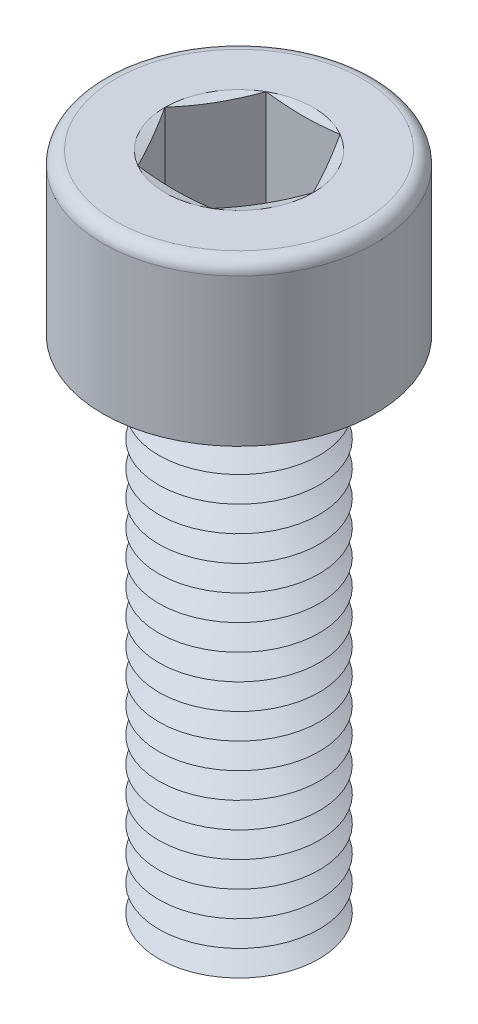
ISO-10303-21;
HEADER;
FILE_DESCRIPTION(('STEP AP214'),'2;1');
FILE_NAME('part.step','',(''),(''),'','','');
FILE_SCHEMA(('AUTOMOTIVE_DESIGN { 1 0 10303 214 1 1 1 1 }'));
ENDSEC;
DATA;
#1=APPLICATION_CONTEXT('core data for automotive mechanical design processes');
#2=APPLICATION_PROTOCOL_DEFINITION('international standard','automotive_design',2000,#1);
#3=PRODUCT_CONTEXT('',#1,'mechanical');
#4=PRODUCT('Part','Part','',(#3));
#5=PRODUCT_RELATED_PRODUCT_CATEGORY('part','',(#4));
#6=PRODUCT_DEFINITION_FORMATION('','',#4);
#7=PRODUCT_DEFINITION_CONTEXT('part definition',#1,'design');
#8=PRODUCT_DEFINITION('design','',#6,#7);
#9=PRODUCT_DEFINITION_SHAPE('','',#8);
#10=(LENGTH_UNIT() NAMED_UNIT(*) SI_UNIT(.MILLI.,.METRE.));
#11=(NAMED_UNIT(*) PLANE_ANGLE_UNIT() SI_UNIT($,.RADIAN.));
#12=(NAMED_UNIT(*) SI_UNIT($,.STERADIAN.) SOLID_ANGLE_UNIT());
#13=UNCERTAINTY_MEASURE_WITH_UNIT(LENGTH_MEASURE(1.E-05),#10,'distance_accuracy_value','');
#14=(GEOMETRIC_REPRESENTATION_CONTEXT(3) GLOBAL_UNCERTAINTY_ASSIGNED_CONTEXT((#13)) GLOBAL_UNIT_ASSIGNED_CONTEXT((#10,
#11,#12)) REPRESENTATION_CONTEXT('',''));
#15=CARTESIAN_POINT('',(0.,0.,0.));
#16=DIRECTION('',(0.,0.,1.));
#17=DIRECTION('',(1.,0.,0.));
#18=AXIS2_PLACEMENT_3D('',#15,#16,#17);
#19=CARTESIAN_POINT('',(0.,3.2,0.));
#20=DIRECTION('',(0.,1.,0.));
#21=DIRECTION('',(0.,0.,1.));
#22=AXIS2_PLACEMENT_3D('',#19,#20,#21);
#23=CONICAL_SURFACE('',#22,1.80717967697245,1.0471975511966);
#24=CARTESIAN_POINT('',(0.,3.6,0.));
#25=DIRECTION('',(0.,1.,0.));
#26=DIRECTION('',(0.,0.,1.));
#27=AXIS2_PLACEMENT_3D('',#24,#25,#26);
#28=CIRCLE('',#27,2.5);
#29=CARTESIAN_POINT('',(0.,3.6,2.5));
#30=VERTEX_POINT('',#29);
#31=EDGE_CURVE('E470',#30,#30,#28,.T.);
#32=ORIENTED_EDGE('',*,*,#31,.F.);
#33=EDGE_LOOP('',(#32));
#34=FACE_BOUND('',#33,.T.);
#35=CARTESIAN_POINT('',(0.,3.2,0.));
#36=DIRECTION('',(0.,1.,0.));
#37=DIRECTION('',(0.,0.,1.));
#38=AXIS2_PLACEMENT_3D('',#35,#36,#37);
#39=CIRCLE('',#38,1.80717967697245);
#40=CARTESIAN_POINT('',(0.,3.2,1.80717967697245));
#41=VERTEX_POINT('',#40);
#42=EDGE_CURVE('E474',#41,#41,#39,.T.);
#43=ORIENTED_EDGE('',*,*,#42,.T.);
#44=EDGE_LOOP('',(#43));
#45=FACE_BOUND('',#44,.T.);
#46=ADVANCED_FACE('F41',(#34,#45),#23,.T.);
#47=CARTESIAN_POINT('',(0.,2.8,0.));
#48=DIRECTION('',(0.,-1.,0.));
#49=DIRECTION('',(0.,0.,-1.));
#50=AXIS2_PLACEMENT_3D('',#47,#48,#49);
#51=CONICAL_SURFACE('',#50,2.5,1.0471975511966);
#52=ORIENTED_EDGE('',*,*,#42,.F.);
#53=EDGE_LOOP('',(#52));
#54=FACE_BOUND('',#53,.T.);
#55=CARTESIAN_POINT('',(0.,2.8,0.));
#56=DIRECTION('',(0.,1.,0.));
#57=DIRECTION('',(0.,0.,1.));
#58=AXIS2_PLACEMENT_3D('',#55,#56,#57);
#59=CIRCLE('',#58,2.5);
#60=CARTESIAN_POINT('',(0.,2.8,2.5));
#61=VERTEX_POINT('',#60);
#62=EDGE_CURVE('E478',#61,#61,#59,.T.);
#63=ORIENTED_EDGE('',*,*,#62,.T.);
#64=EDGE_LOOP('',(#63));
#65=FACE_BOUND('',#64,.T.);
#66=ADVANCED_FACE('F251',(#54,#65),#51,.T.);
#67=CARTESIAN_POINT('',(0.,0.,0.));
#68=DIRECTION('',(0.,1.,0.));
#69=DIRECTION('',(0.,0.,1.));
#70=AXIS2_PLACEMENT_3D('',#67,#68,#69);
#71=PLANE('',#70);
#72=CARTESIAN_POINT('',(0.,0.,0.));
#73=DIRECTION('',(0.,1.,0.));
#74=DIRECTION('',(0.,0.,1.));
#75=AXIS2_PLACEMENT_3D('',#72,#73,#74);
#76=CIRCLE('',#75,1.80717967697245);
#77=CARTESIAN_POINT('',(0.,0.,1.80717967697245));
#78=VERTEX_POINT('',#77);
#79=EDGE_CURVE('E506',#78,#78,#76,.T.);
#80=ORIENTED_EDGE('',*,*,#79,.F.);
#81=EDGE_LOOP('',(#80));
#82=FACE_BOUND('',#81,.T.);
#83=ADVANCED_FACE('F248',(#82),#71,.F.);
#84=CARTESIAN_POINT('',(0.,0.,0.));
#85=DIRECTION('',(0.,1.,0.));
#86=DIRECTION('',(0.,0.,1.));
#87=AXIS2_PLACEMENT_3D('',#84,#85,#86);
#88=CONICAL_SURFACE('',#87,1.80717967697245,1.0471975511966);
#89=CARTESIAN_POINT('',(0.,0.399999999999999,0.));
#90=DIRECTION('',(0.,1.,0.));
#91=DIRECTION('',(0.,0.,1.));
#92=AXIS2_PLACEMENT_3D('',#89,#90,#91);
#93=CIRCLE('',#92,2.5);
#94=CARTESIAN_POINT('',(0.,0.399999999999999,2.5));
#95=VERTEX_POINT('',#94);
#96=EDGE_CURVE('E502',#95,#95,#93,.T.);
#97=ORIENTED_EDGE('',*,*,#96,.F.);
#98=EDGE_LOOP('',(#97));
#99=FACE_BOUND('',#98,.T.);
#100=ORIENTED_EDGE('',*,*,#79,.T.);
#101=EDGE_LOOP('',(#100));
#102=FACE_BOUND('',#101,.T.);
#103=ADVANCED_FACE('F250',(#99,#102),#88,.T.);
#104=CARTESIAN_POINT('',(0.,0.399999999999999,0.));
#105=DIRECTION('',(0.,-1.,0.));
#106=DIRECTION('',(0.,0.,-1.));
#107=AXIS2_PLACEMENT_3D('',#104,#105,#106);
#108=CONICAL_SURFACE('',#107,2.5,1.0471975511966);
#109=CARTESIAN_POINT('',(0.,0.8,0.));
#110=DIRECTION('',(0.,1.,0.));
#111=DIRECTION('',(0.,0.,1.));
#112=AXIS2_PLACEMENT_3D('',#109,#110,#111);
#113=CIRCLE('',#112,1.80717967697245);
#114=CARTESIAN_POINT('',(0.,0.8,1.80717967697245));
#115=VERTEX_POINT('',#114);
#116=EDGE_CURVE('E498',#115,#115,#113,.T.);
#117=ORIENTED_EDGE('',*,*,#116,.F.);
#118=EDGE_LOOP('',(#117));
#119=FACE_BOUND('',#118,.T.);
#120=ORIENTED_EDGE('',*,*,#96,.T.);
#121=EDGE_LOOP('',(#120));
#122=FACE_BOUND('',#121,.T.);
#123=ADVANCED_FACE('F291',(#119,#122),#108,.T.);
#124=CARTESIAN_POINT('',(0.,0.8,0.));
#125=DIRECTION('',(0.,1.,0.));
#126=DIRECTION('',(0.,0.,1.));
#127=AXIS2_PLACEMENT_3D('',#124,#125,#126);
#128=CONICAL_SURFACE('',#127,1.80717967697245,1.0471975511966);
#129=CARTESIAN_POINT('',(0.,1.2,0.));
#130=DIRECTION('',(0.,1.,0.));
#131=DIRECTION('',(0.,0.,1.));
#132=AXIS2_PLACEMENT_3D('',#129,#130,#131);
#133=CIRCLE('',#132,2.5);
#134=CARTESIAN_POINT('',(0.,1.2,2.5));
#135=VERTEX_POINT('',#134);
#136=EDGE_CURVE('E494',#135,#135,#133,.T.);
#137=ORIENTED_EDGE('',*,*,#136,.F.);
#138=EDGE_LOOP('',(#137));
#139=FACE_BOUND('',#138,.T.);
#140=ORIENTED_EDGE('',*,*,#116,.T.);
#141=EDGE_LOOP('',(#140));
#142=FACE_BOUND('',#141,.T.);
#143=ADVANCED_FACE('F286',(#139,#142),#128,.T.);
#144=CARTESIAN_POINT('',(0.,1.2,0.));
#145=DIRECTION('',(0.,-1.,0.));
#146=DIRECTION('',(0.,0.,-1.));
#147=AXIS2_PLACEMENT_3D('',#144,#145,#146);
#148=CONICAL_SURFACE('',#147,2.5,1.0471975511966);
#149=CARTESIAN_POINT('',(0.,1.6,0.));
#150=DIRECTION('',(0.,1.,0.));
#151=DIRECTION('',(0.,0.,1.));
#152=AXIS2_PLACEMENT_3D('',#149,#150,#151);
#153=CIRCLE('',#152,1.80717967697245);
#154=CARTESIAN_POINT('',(0.,1.6,1.80717967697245));
#155=VERTEX_POINT('',#154);
#156=EDGE_CURVE('E490',#155,#155,#153,.T.);
#157=ORIENTED_EDGE('',*,*,#156,.F.);
#158=EDGE_LOOP('',(#157));
#159=FACE_BOUND('',#158,.T.);
#160=ORIENTED_EDGE('',*,*,#136,.T.);
#161=EDGE_LOOP('',(#160));
#162=FACE_BOUND('',#161,.T.);
#163=ADVANCED_FACE('F283',(#159,#162),#148,.T.);
#164=CARTESIAN_POINT('',(0.,1.6,0.));
#165=DIRECTION('',(0.,1.,0.));
#166=DIRECTION('',(0.,0.,1.));
#167=AXIS2_PLACEMENT_3D('',#164,#165,#166);
#168=CONICAL_SURFACE('',#167,1.80717967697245,1.0471975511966);
#169=CARTESIAN_POINT('',(0.,2.,0.));
#170=DIRECTION('',(0.,1.,0.));
#171=DIRECTION('',(0.,0.,1.));
#172=AXIS2_PLACEMENT_3D('',#169,#170,#171);
#173=CIRCLE('',#172,2.5);
#174=CARTESIAN_POINT('',(0.,2.,2.5));
#175=VERTEX_POINT('',#174);
#176=EDGE_CURVE('E486',#175,#175,#173,.T.);
#177=ORIENTED_EDGE('',*,*,#176,.F.);
#178=EDGE_LOOP('',(#177));
#179=FACE_BOUND('',#178,.T.);
#180=ORIENTED_EDGE('',*,*,#156,.T.);
#181=EDGE_LOOP('',(#180));
#182=FACE_BOUND('',#181,.T.);
#183=ADVANCED_FACE('F277',(#179,#182),#168,.T.);
#184=CARTESIAN_POINT('',(0.,2.,0.));
#185=DIRECTION('',(0.,-1.,0.));
#186=DIRECTION('',(0.,0.,-1.));
#187=AXIS2_PLACEMENT_3D('',#184,#185,#186);
#188=CONICAL_SURFACE('',#187,2.5,1.0471975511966);
#189=CARTESIAN_POINT('',(0.,2.4,0.));
#190=DIRECTION('',(0.,1.,0.));
#191=DIRECTION('',(0.,0.,1.));
#192=AXIS2_PLACEMENT_3D('',#189,#190,#191);
#193=CIRCLE('',#192,1.80717967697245);
#194=CARTESIAN_POINT('',(0.,2.4,1.80717967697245));
#195=VERTEX_POINT('',#194);
#196=EDGE_CURVE('E482',#195,#195,#193,.T.);
#197=ORIENTED_EDGE('',*,*,#196,.F.);
#198=EDGE_LOOP('',(#197));
#199=FACE_BOUND('',#198,.T.);
#200=ORIENTED_EDGE('',*,*,#176,.T.);
#201=EDGE_LOOP('',(#200));
#202=FACE_BOUND('',#201,.T.);
#203=ADVANCED_FACE('F273',(#199,#202),#188,.T.);
#204=CARTESIAN_POINT('',(0.,2.4,0.));
#205=DIRECTION('',(0.,1.,0.));
#206=DIRECTION('',(0.,0.,1.));
#207=AXIS2_PLACEMENT_3D('',#204,#205,#206);
#208=CONICAL_SURFACE('',#207,1.80717967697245,1.0471975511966);
#209=ORIENTED_EDGE('',*,*,#62,.F.);
#210=EDGE_LOOP('',(#209));
#211=FACE_BOUND('',#210,.T.);
#212=ORIENTED_EDGE('',*,*,#196,.T.);
#213=EDGE_LOOP('',(#212));
#214=FACE_BOUND('',#213,.T.);
#215=ADVANCED_FACE('F276',(#211,#214),#208,.T.);
#216=CARTESIAN_POINT('',(0.,4.,0.));
#217=DIRECTION('',(0.,1.,0.));
#218=DIRECTION('',(0.,0.,1.));
#219=AXIS2_PLACEMENT_3D('',#216,#217,#218);
#220=CONICAL_SURFACE('',#219,1.80717967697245,1.0471975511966);
#221=CARTESIAN_POINT('',(0.,4.4,0.));
#222=DIRECTION('',(0.,1.,0.));
#223=DIRECTION('',(0.,0.,1.));
#224=AXIS2_PLACEMENT_3D('',#221,#222,#223);
#225=CIRCLE('',#224,2.5);
#226=CARTESIAN_POINT('',(0.,4.4,2.5));
#227=VERTEX_POINT('',#226);
#228=EDGE_CURVE('E462',#227,#227,#225,.T.);
#229=ORIENTED_EDGE('',*,*,#228,.F.);
#230=EDGE_LOOP('',(#229));
#231=FACE_BOUND('',#230,.T.);
#232=CARTESIAN_POINT('',(0.,4.,0.));
#233=DIRECTION('',(0.,1.,0.));
#234=DIRECTION('',(0.,0.,1.));
#235=AXIS2_PLACEMENT_3D('',#232,#233,#234);
#236=CIRCLE('',#235,1.80717967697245);
#237=CARTESIAN_POINT('',(0.,4.,1.80717967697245));
#238=VERTEX_POINT('',#237);
#239=EDGE_CURVE('E466',#238,#238,#236,.T.);
#240=ORIENTED_EDGE('',*,*,#239,.T.);
#241=EDGE_LOOP('',(#240));
#242=FACE_BOUND('',#241,.T.);
#243=ADVANCED_FACE('F281',(#231,#242),#220,.T.);
#244=CARTESIAN_POINT('',(0.,3.6,0.));
#245=DIRECTION('',(0.,-1.,0.));
#246=DIRECTION('',(0.,0.,-1.));
#247=AXIS2_PLACEMENT_3D('',#244,#245,#246);
#248=CONICAL_SURFACE('',#247,2.5,1.0471975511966);
#249=ORIENTED_EDGE('',*,*,#239,.F.);
#250=EDGE_LOOP('',(#249));
#251=FACE_BOUND('',#250,.T.);
#252=ORIENTED_EDGE('',*,*,#31,.T.);
#253=EDGE_LOOP('',(#252));
#254=FACE_BOUND('',#253,.T.);
#255=ADVANCED_FACE('F873',(#251,#254),#248,.T.);
#256=CARTESIAN_POINT('',(0.,4.8,0.));
#257=DIRECTION('',(0.,1.,0.));
#258=DIRECTION('',(0.,0.,1.));
#259=AXIS2_PLACEMENT_3D('',#256,#257,#258);
#260=CONICAL_SURFACE('',#259,1.80717967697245,1.0471975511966);
#261=CARTESIAN_POINT('',(0.,5.2,0.));
#262=DIRECTION('',(0.,1.,0.));
#263=DIRECTION('',(0.,0.,1.));
#264=AXIS2_PLACEMENT_3D('',#261,#262,#263);
#265=CIRCLE('',#264,2.5);
#266=CARTESIAN_POINT('',(0.,5.2,2.5));
#267=VERTEX_POINT('',#266);
#268=EDGE_CURVE('E454',#267,#267,#265,.T.);
#269=ORIENTED_EDGE('',*,*,#268,.F.);
#270=EDGE_LOOP('',(#269));
#271=FACE_BOUND('',#270,.T.);
#272=CARTESIAN_POINT('',(0.,4.8,0.));
#273=DIRECTION('',(0.,1.,0.));
#274=DIRECTION('',(0.,0.,1.));
#275=AXIS2_PLACEMENT_3D('',#272,#273,#274);
#276=CIRCLE('',#275,1.80717967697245);
#277=CARTESIAN_POINT('',(0.,4.8,1.80717967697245));
#278=VERTEX_POINT('',#277);
#279=EDGE_CURVE('E458',#278,#278,#276,.T.);
#280=ORIENTED_EDGE('',*,*,#279,.T.);
#281=EDGE_LOOP('',(#280));
#282=FACE_BOUND('',#281,.T.);
#283=ADVANCED_FACE('F864',(#271,#282),#260,.T.);
#284=CARTESIAN_POINT('',(0.,4.4,0.));
#285=DIRECTION('',(0.,-1.,0.));
#286=DIRECTION('',(0.,0.,-1.));
#287=AXIS2_PLACEMENT_3D('',#284,#285,#286);
#288=CONICAL_SURFACE('',#287,2.5,1.0471975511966);
#289=ORIENTED_EDGE('',*,*,#279,.F.);
#290=EDGE_LOOP('',(#289));
#291=FACE_BOUND('',#290,.T.);
#292=ORIENTED_EDGE('',*,*,#228,.T.);
#293=EDGE_LOOP('',(#292));
#294=FACE_BOUND('',#293,.T.);
#295=ADVANCED_FACE('F855',(#291,#294),#288,.T.);
#296=CARTESIAN_POINT('',(0.,5.6,0.));
#297=DIRECTION('',(0.,1.,0.));
#298=DIRECTION('',(0.,0.,1.));
#299=AXIS2_PLACEMENT_3D('',#296,#297,#298);
#300=CONICAL_SURFACE('',#299,1.80717967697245,1.0471975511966);
#301=CARTESIAN_POINT('',(0.,6.,0.));
#302=DIRECTION('',(0.,1.,0.));
#303=DIRECTION('',(0.,0.,1.));
#304=AXIS2_PLACEMENT_3D('',#301,#302,#303);
#305=CIRCLE('',#304,2.5);
#306=CARTESIAN_POINT('',(0.,6.,2.5));
#307=VERTEX_POINT('',#306);
#308=EDGE_CURVE('E446',#307,#307,#305,.T.);
#309=ORIENTED_EDGE('',*,*,#308,.F.);
#310=EDGE_LOOP('',(#309));
#311=FACE_BOUND('',#310,.T.);
#312=CARTESIAN_POINT('',(0.,5.6,0.));
#313=DIRECTION('',(0.,1.,0.));
#314=DIRECTION('',(0.,0.,1.));
#315=AXIS2_PLACEMENT_3D('',#312,#313,#314);
#316=CIRCLE('',#315,1.80717967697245);
#317=CARTESIAN_POINT('',(0.,5.6,1.80717967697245));
#318=VERTEX_POINT('',#317);
#319=EDGE_CURVE('E450',#318,#318,#316,.T.);
#320=ORIENTED_EDGE('',*,*,#319,.T.);
#321=EDGE_LOOP('',(#320));
#322=FACE_BOUND('',#321,.T.);
#323=ADVANCED_FACE('F846',(#311,#322),#300,.T.);
#324=CARTESIAN_POINT('',(0.,5.2,0.));
#325=DIRECTION('',(0.,-1.,0.));
#326=DIRECTION('',(0.,0.,-1.));
#327=AXIS2_PLACEMENT_3D('',#324,#325,#326);
#328=CONICAL_SURFACE('',#327,2.5,1.0471975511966);
#329=ORIENTED_EDGE('',*,*,#319,.F.);
#330=EDGE_LOOP('',(#329));
#331=FACE_BOUND('',#330,.T.);
#332=ORIENTED_EDGE('',*,*,#268,.T.);
#333=EDGE_LOOP('',(#332));
#334=FACE_BOUND('',#333,.T.);
#335=ADVANCED_FACE('F837',(#331,#334),#328,.T.);
#336=CARTESIAN_POINT('',(0.,6.4,0.));
#337=DIRECTION('',(0.,1.,0.));
#338=DIRECTION('',(0.,0.,1.));
#339=AXIS2_PLACEMENT_3D('',#336,#337,#338);
#340=CONICAL_SURFACE('',#339,1.80717967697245,1.0471975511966);
#341=CARTESIAN_POINT('',(0.,6.8,0.));
#342=DIRECTION('',(0.,1.,0.));
#343=DIRECTION('',(0.,0.,1.));
#344=AXIS2_PLACEMENT_3D('',#341,#342,#343);
#345=CIRCLE('',#344,2.5);
#346=CARTESIAN_POINT('',(0.,6.8,2.5));
#347=VERTEX_POINT('',#346);
#348=EDGE_CURVE('E438',#347,#347,#345,.T.);
#349=ORIENTED_EDGE('',*,*,#348,.F.);
#350=EDGE_LOOP('',(#349));
#351=FACE_BOUND('',#350,.T.);
#352=CARTESIAN_POINT('',(0.,6.4,0.));
#353=DIRECTION('',(0.,1.,0.));
#354=DIRECTION('',(0.,0.,1.));
#355=AXIS2_PLACEMENT_3D('',#352,#353,#354);
#356=CIRCLE('',#355,1.80717967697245);
#357=CARTESIAN_POINT('',(0.,6.4,1.80717967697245));
#358=VERTEX_POINT('',#357);
#359=EDGE_CURVE('E442',#358,#358,#356,.T.);
#360=ORIENTED_EDGE('',*,*,#359,.T.);
#361=EDGE_LOOP('',(#360));
#362=FACE_BOUND('',#361,.T.);
#363=ADVANCED_FACE('F828',(#351,#362),#340,.T.);
#364=CARTESIAN_POINT('',(0.,6.,0.));
#365=DIRECTION('',(0.,-1.,0.));
#366=DIRECTION('',(0.,0.,-1.));
#367=AXIS2_PLACEMENT_3D('',#364,#365,#366);
#368=CONICAL_SURFACE('',#367,2.5,1.0471975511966);
#369=ORIENTED_EDGE('',*,*,#359,.F.);
#370=EDGE_LOOP('',(#369));
#371=FACE_BOUND('',#370,.T.);
#372=ORIENTED_EDGE('',*,*,#308,.T.);
#373=EDGE_LOOP('',(#372));
#374=FACE_BOUND('',#373,.T.);
#375=ADVANCED_FACE('F819',(#371,#374),#368,.T.);
#376=CARTESIAN_POINT('',(0.,7.2,0.));
#377=DIRECTION('',(0.,1.,0.));
#378=DIRECTION('',(0.,0.,1.));
#379=AXIS2_PLACEMENT_3D('',#376,#377,#378);
#380=CONICAL_SURFACE('',#379,1.80717967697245,1.0471975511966);
#381=CARTESIAN_POINT('',(0.,7.6,0.));
#382=DIRECTION('',(0.,1.,0.));
#383=DIRECTION('',(0.,0.,1.));
#384=AXIS2_PLACEMENT_3D('',#381,#382,#383);
#385=CIRCLE('',#384,2.5);
#386=CARTESIAN_POINT('',(0.,7.6,2.5));
#387=VERTEX_POINT('',#386);
#388=EDGE_CURVE('E430',#387,#387,#385,.T.);
#389=ORIENTED_EDGE('',*,*,#388,.F.);
#390=EDGE_LOOP('',(#389));
#391=FACE_BOUND('',#390,.T.);
#392=CARTESIAN_POINT('',(0.,7.2,0.));
#393=DIRECTION('',(0.,1.,0.));
#394=DIRECTION('',(0.,0.,1.));
#395=AXIS2_PLACEMENT_3D('',#392,#393,#394);
#396=CIRCLE('',#395,1.80717967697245);
#397=CARTESIAN_POINT('',(0.,7.2,1.80717967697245));
#398=VERTEX_POINT('',#397);
#399=EDGE_CURVE('E434',#398,#398,#396,.T.);
#400=ORIENTED_EDGE('',*,*,#399,.T.);
#401=EDGE_LOOP('',(#400));
#402=FACE_BOUND('',#401,.T.);
#403=ADVANCED_FACE('F810',(#391,#402),#380,.T.);
#404=CARTESIAN_POINT('',(0.,6.8,0.));
#405=DIRECTION('',(0.,-1.,0.));
#406=DIRECTION('',(0.,0.,-1.));
#407=AXIS2_PLACEMENT_3D('',#404,#405,#406);
#408=CONICAL_SURFACE('',#407,2.5,1.0471975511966);
#409=ORIENTED_EDGE('',*,*,#399,.F.);
#410=EDGE_LOOP('',(#409));
#411=FACE_BOUND('',#410,.T.);
#412=ORIENTED_EDGE('',*,*,#348,.T.);
#413=EDGE_LOOP('',(#412));
#414=FACE_BOUND('',#413,.T.);
#415=ADVANCED_FACE('F801',(#411,#414),#408,.T.);
#416=CARTESIAN_POINT('',(0.,8.,0.));
#417=DIRECTION('',(0.,1.,0.));
#418=DIRECTION('',(0.,0.,1.));
#419=AXIS2_PLACEMENT_3D('',#416,#417,#418);
#420=CONICAL_SURFACE('',#419,1.80717967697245,1.0471975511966);
#421=CARTESIAN_POINT('',(0.,8.4,0.));
#422=DIRECTION('',(0.,1.,0.));
#423=DIRECTION('',(0.,0.,1.));
#424=AXIS2_PLACEMENT_3D('',#421,#422,#423);
#425=CIRCLE('',#424,2.5);
#426=CARTESIAN_POINT('',(0.,8.4,2.5));
#427=VERTEX_POINT('',#426);
#428=EDGE_CURVE('E423',#427,#427,#425,.T.);
#429=ORIENTED_EDGE('',*,*,#428,.F.);
#430=EDGE_LOOP('',(#429));
#431=FACE_BOUND('',#430,.T.);
#432=CARTESIAN_POINT('',(0.,8.,0.));
#433=DIRECTION('',(0.,1.,0.));
#434=DIRECTION('',(0.,0.,1.));
#435=AXIS2_PLACEMENT_3D('',#432,#433,#434);
#436=CIRCLE('',#435,1.80717967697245);
#437=CARTESIAN_POINT('',(0.,8.,1.80717967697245));
#438=VERTEX_POINT('',#437);
#439=EDGE_CURVE('E426',#438,#438,#436,.T.);
#440=ORIENTED_EDGE('',*,*,#439,.T.);
#441=EDGE_LOOP('',(#440));
#442=FACE_BOUND('',#441,.T.);
#443=ADVANCED_FACE('F792',(#431,#442),#420,.T.);
#444=CARTESIAN_POINT('',(0.,7.6,0.));
#445=DIRECTION('',(0.,-1.,0.));
#446=DIRECTION('',(0.,0.,-1.));
#447=AXIS2_PLACEMENT_3D('',#444,#445,#446);
#448=CONICAL_SURFACE('',#447,2.5,1.0471975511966);
#449=ORIENTED_EDGE('',*,*,#439,.F.);
#450=EDGE_LOOP('',(#449));
#451=FACE_BOUND('',#450,.T.);
#452=ORIENTED_EDGE('',*,*,#388,.T.);
#453=EDGE_LOOP('',(#452));
#454=FACE_BOUND('',#453,.T.);
#455=ADVANCED_FACE('F783',(#451,#454),#448,.T.);
#456=CARTESIAN_POINT('',(0.,8.8,0.));
#457=DIRECTION('',(0.,1.,0.));
#458=DIRECTION('',(0.,0.,1.));
#459=AXIS2_PLACEMENT_3D('',#456,#457,#458);
#460=CONICAL_SURFACE('',#459,1.80717967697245,1.0471975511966);
#461=CARTESIAN_POINT('',(0.,9.2,0.));
#462=DIRECTION('',(0.,1.,0.));
#463=DIRECTION('',(0.,0.,1.));
#464=AXIS2_PLACEMENT_3D('',#461,#462,#463);
#465=CIRCLE('',#464,2.5);
#466=CARTESIAN_POINT('',(0.,9.2,2.5));
#467=VERTEX_POINT('',#466);
#468=EDGE_CURVE('E415',#467,#467,#465,.T.);
#469=ORIENTED_EDGE('',*,*,#468,.F.);
#470=EDGE_LOOP('',(#469));
#471=FACE_BOUND('',#470,.T.);
#472=CARTESIAN_POINT('',(0.,8.8,0.));
#473=DIRECTION('',(0.,1.,0.));
#474=DIRECTION('',(0.,0.,1.));
#475=AXIS2_PLACEMENT_3D('',#472,#473,#474);
#476=CIRCLE('',#475,1.80717967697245);
#477=CARTESIAN_POINT('',(0.,8.8,1.80717967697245));
#478=VERTEX_POINT('',#477);
#479=EDGE_CURVE('E419',#478,#478,#476,.T.);
#480=ORIENTED_EDGE('',*,*,#479,.T.);
#481=EDGE_LOOP('',(#480));
#482=FACE_BOUND('',#481,.T.);
#483=ADVANCED_FACE('F774',(#471,#482),#460,.T.);
#484=CARTESIAN_POINT('',(0.,8.4,0.));
#485=DIRECTION('',(0.,-1.,0.));
#486=DIRECTION('',(0.,0.,-1.));
#487=AXIS2_PLACEMENT_3D('',#484,#485,#486);
#488=CONICAL_SURFACE('',#487,2.5,1.0471975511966);
#489=ORIENTED_EDGE('',*,*,#479,.F.);
#490=EDGE_LOOP('',(#489));
#491=FACE_BOUND('',#490,.T.);
#492=ORIENTED_EDGE('',*,*,#428,.T.);
#493=EDGE_LOOP('',(#492));
#494=FACE_BOUND('',#493,.T.);
#495=ADVANCED_FACE('F765',(#491,#494),#488,.T.);
#496=CARTESIAN_POINT('',(0.,9.6,0.));
#497=DIRECTION('',(0.,1.,0.));
#498=DIRECTION('',(0.,0.,1.));
#499=AXIS2_PLACEMENT_3D('',#496,#497,#498);
#500=CONICAL_SURFACE('',#499,1.80717967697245,1.0471975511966);
#501=CARTESIAN_POINT('',(0.,10.,0.));
#502=DIRECTION('',(0.,1.,0.));
#503=DIRECTION('',(0.,0.,1.));
#504=AXIS2_PLACEMENT_3D('',#501,#502,#503);
#505=CIRCLE('',#504,2.5);
#506=CARTESIAN_POINT('',(0.,10.,2.5));
#507=VERTEX_POINT('',#506);
#508=EDGE_CURVE('E407',#507,#507,#505,.T.);
#509=ORIENTED_EDGE('',*,*,#508,.F.);
#510=EDGE_LOOP('',(#509));
#511=FACE_BOUND('',#510,.T.);
#512=CARTESIAN_POINT('',(0.,9.6,0.));
#513=DIRECTION('',(0.,1.,0.));
#514=DIRECTION('',(0.,0.,1.));
#515=AXIS2_PLACEMENT_3D('',#512,#513,#514);
#516=CIRCLE('',#515,1.80717967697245);
#517=CARTESIAN_POINT('',(0.,9.6,1.80717967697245));
#518=VERTEX_POINT('',#517);
#519=EDGE_CURVE('E411',#518,#518,#516,.T.);
#520=ORIENTED_EDGE('',*,*,#519,.T.);
#521=EDGE_LOOP('',(#520));
#522=FACE_BOUND('',#521,.T.);
#523=ADVANCED_FACE('F756',(#511,#522),#500,.T.);
#524=CARTESIAN_POINT('',(0.,9.2,0.));
#525=DIRECTION('',(0.,-1.,0.));
#526=DIRECTION('',(0.,0.,-1.));
#527=AXIS2_PLACEMENT_3D('',#524,#525,#526);
#528=CONICAL_SURFACE('',#527,2.5,1.0471975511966);
#529=ORIENTED_EDGE('',*,*,#519,.F.);
#530=EDGE_LOOP('',(#529));
#531=FACE_BOUND('',#530,.T.);
#532=ORIENTED_EDGE('',*,*,#468,.T.);
#533=EDGE_LOOP('',(#532));
#534=FACE_BOUND('',#533,.T.);
#535=ADVANCED_FACE('F747',(#531,#534),#528,.T.);
#536=CARTESIAN_POINT('',(0.,10.4,0.));
#537=DIRECTION('',(0.,1.,0.));
#538=DIRECTION('',(0.,0.,1.));
#539=AXIS2_PLACEMENT_3D('',#536,#537,#538);
#540=CONICAL_SURFACE('',#539,1.80717967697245,1.0471975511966);
#541=CARTESIAN_POINT('',(0.,10.8,0.));
#542=DIRECTION('',(0.,1.,0.));
#543=DIRECTION('',(0.,0.,1.));
#544=AXIS2_PLACEMENT_3D('',#541,#542,#543);
#545=CIRCLE('',#544,2.5);
#546=CARTESIAN_POINT('',(0.,10.8,2.5));
#547=VERTEX_POINT('',#546);
#548=EDGE_CURVE('E400',#547,#547,#545,.T.);
#549=ORIENTED_EDGE('',*,*,#548,.F.);
#550=EDGE_LOOP('',(#549));
#551=FACE_BOUND('',#550,.T.);
#552=CARTESIAN_POINT('',(0.,10.4,0.));
#553=DIRECTION('',(0.,1.,0.));
#554=DIRECTION('',(0.,0.,1.));
#555=AXIS2_PLACEMENT_3D('',#552,#553,#554);
#556=CIRCLE('',#555,1.80717967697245);
#557=CARTESIAN_POINT('',(0.,10.4,1.80717967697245));
#558=VERTEX_POINT('',#557);
#559=EDGE_CURVE('E404',#558,#558,#556,.T.);
#560=ORIENTED_EDGE('',*,*,#559,.T.);
#561=EDGE_LOOP('',(#560));
#562=FACE_BOUND('',#561,.T.);
#563=ADVANCED_FACE('F738',(#551,#562),#540,.T.);
#564=CARTESIAN_POINT('',(0.,10.,0.));
#565=DIRECTION('',(0.,-1.,0.));
#566=DIRECTION('',(0.,0.,-1.));
#567=AXIS2_PLACEMENT_3D('',#564,#565,#566);
#568=CONICAL_SURFACE('',#567,2.5,1.0471975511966);
#569=ORIENTED_EDGE('',*,*,#559,.F.);
#570=EDGE_LOOP('',(#569));
#571=FACE_BOUND('',#570,.T.);
#572=ORIENTED_EDGE('',*,*,#508,.T.);
#573=EDGE_LOOP('',(#572));
#574=FACE_BOUND('',#573,.T.);
#575=ADVANCED_FACE('F729',(#571,#574),#568,.T.);
#576=CARTESIAN_POINT('',(0.,11.2,0.));
#577=DIRECTION('',(0.,1.,0.));
#578=DIRECTION('',(0.,0.,1.));
#579=AXIS2_PLACEMENT_3D('',#576,#577,#578);
#580=CONICAL_SURFACE('',#579,1.80717967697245,1.0471975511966);
#581=CARTESIAN_POINT('',(0.,11.6,0.));
#582=DIRECTION('',(0.,1.,0.));
#583=DIRECTION('',(0.,0.,1.));
#584=AXIS2_PLACEMENT_3D('',#581,#582,#583);
#585=CIRCLE('',#584,2.5);
#586=CARTESIAN_POINT('',(0.,11.6,2.5));
#587=VERTEX_POINT('',#586);
#588=EDGE_CURVE('E392',#587,#587,#585,.T.);
#589=ORIENTED_EDGE('',*,*,#588,.F.);
#590=EDGE_LOOP('',(#589));
#591=FACE_BOUND('',#590,.T.);
#592=CARTESIAN_POINT('',(0.,11.2,0.));
#593=DIRECTION('',(0.,1.,0.));
#594=DIRECTION('',(0.,0.,1.));
#595=AXIS2_PLACEMENT_3D('',#592,#593,#594);
#596=CIRCLE('',#595,1.80717967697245);
#597=CARTESIAN_POINT('',(0.,11.2,1.80717967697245));
#598=VERTEX_POINT('',#597);
#599=EDGE_CURVE('E396',#598,#598,#596,.T.);
#600=ORIENTED_EDGE('',*,*,#599,.T.);
#601=EDGE_LOOP('',(#600));
#602=FACE_BOUND('',#601,.T.);
#603=ADVANCED_FACE('F720',(#591,#602),#580,.T.);
#604=CARTESIAN_POINT('',(0.,10.8,0.));
#605=DIRECTION('',(0.,-1.,0.));
#606=DIRECTION('',(0.,0.,-1.));
#607=AXIS2_PLACEMENT_3D('',#604,#605,#606);
#608=CONICAL_SURFACE('',#607,2.5,1.0471975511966);
#609=ORIENTED_EDGE('',*,*,#599,.F.);
#610=EDGE_LOOP('',(#609));
#611=FACE_BOUND('',#610,.T.);
#612=ORIENTED_EDGE('',*,*,#548,.T.);
#613=EDGE_LOOP('',(#612));
#614=FACE_BOUND('',#613,.T.);
#615=ADVANCED_FACE('F711',(#611,#614),#608,.T.);
#616=CARTESIAN_POINT('',(0.,12.,0.));
#617=DIRECTION('',(0.,1.,0.));
#618=DIRECTION('',(0.,0.,1.));
#619=AXIS2_PLACEMENT_3D('',#616,#617,#618);
#620=CONICAL_SURFACE('',#619,1.80717967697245,1.0471975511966);
#621=CARTESIAN_POINT('',(0.,12.4,0.));
#622=DIRECTION('',(0.,1.,0.));
#623=DIRECTION('',(0.,0.,1.));
#624=AXIS2_PLACEMENT_3D('',#621,#622,#623);
#625=CIRCLE('',#624,2.5);
#626=CARTESIAN_POINT('',(0.,12.4,2.5));
#627=VERTEX_POINT('',#626);
#628=EDGE_CURVE('E384',#627,#627,#625,.T.);
#629=ORIENTED_EDGE('',*,*,#628,.F.);
#630=EDGE_LOOP('',(#629));
#631=FACE_BOUND('',#630,.T.);
#632=CARTESIAN_POINT('',(0.,12.,0.));
#633=DIRECTION('',(0.,1.,0.));
#634=DIRECTION('',(0.,0.,1.));
#635=AXIS2_PLACEMENT_3D('',#632,#633,#634);
#636=CIRCLE('',#635,1.80717967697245);
#637=CARTESIAN_POINT('',(0.,12.,1.80717967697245));
#638=VERTEX_POINT('',#637);
#639=EDGE_CURVE('E388',#638,#638,#636,.T.);
#640=ORIENTED_EDGE('',*,*,#639,.T.);
#641=EDGE_LOOP('',(#640));
#642=FACE_BOUND('',#641,.T.);
#643=ADVANCED_FACE('F702',(#631,#642),#620,.T.);
#644=CARTESIAN_POINT('',(0.,11.6,0.));
#645=DIRECTION('',(0.,-1.,0.));
#646=DIRECTION('',(0.,0.,-1.));
#647=AXIS2_PLACEMENT_3D('',#644,#645,#646);
#648=CONICAL_SURFACE('',#647,2.5,1.0471975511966);
#649=ORIENTED_EDGE('',*,*,#639,.F.);
#650=EDGE_LOOP('',(#649));
#651=FACE_BOUND('',#650,.T.);
#652=ORIENTED_EDGE('',*,*,#588,.T.);
#653=EDGE_LOOP('',(#652));
#654=FACE_BOUND('',#653,.T.);
#655=ADVANCED_FACE('F693',(#651,#654),#648,.T.);
#656=CARTESIAN_POINT('',(0.,12.8,0.));
#657=DIRECTION('',(0.,1.,0.));
#658=DIRECTION('',(0.,0.,1.));
#659=AXIS2_PLACEMENT_3D('',#656,#657,#658);
#660=CONICAL_SURFACE('',#659,1.80717967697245,1.0471975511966);
#661=CARTESIAN_POINT('',(0.,13.2,0.));
#662=DIRECTION('',(0.,1.,0.));
#663=DIRECTION('',(0.,0.,1.));
#664=AXIS2_PLACEMENT_3D('',#661,#662,#663);
#665=CIRCLE('',#664,2.5);
#666=CARTESIAN_POINT('',(0.,13.2,2.5));
#667=VERTEX_POINT('',#666);
#668=EDGE_CURVE('E376',#667,#667,#665,.T.);
#669=ORIENTED_EDGE('',*,*,#668,.F.);
#670=EDGE_LOOP('',(#669));
#671=FACE_BOUND('',#670,.T.);
#672=CARTESIAN_POINT('',(0.,12.8,0.));
#673=DIRECTION('',(0.,1.,0.));
#674=DIRECTION('',(0.,0.,1.));
#675=AXIS2_PLACEMENT_3D('',#672,#673,#674);
#676=CIRCLE('',#675,1.80717967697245);
#677=CARTESIAN_POINT('',(0.,12.8,1.80717967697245));
#678=VERTEX_POINT('',#677);
#679=EDGE_CURVE('E380',#678,#678,#676,.T.);
#680=ORIENTED_EDGE('',*,*,#679,.T.);
#681=EDGE_LOOP('',(#680));
#682=FACE_BOUND('',#681,.T.);
#683=ADVANCED_FACE('F684',(#671,#682),#660,.T.);
#684=CARTESIAN_POINT('',(0.,12.4,0.));
#685=DIRECTION('',(0.,-1.,0.));
#686=DIRECTION('',(0.,0.,-1.));
#687=AXIS2_PLACEMENT_3D('',#684,#685,#686);
#688=CONICAL_SURFACE('',#687,2.5,1.0471975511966);
#689=ORIENTED_EDGE('',*,*,#679,.F.);
#690=EDGE_LOOP('',(#689));
#691=FACE_BOUND('',#690,.T.);
#692=ORIENTED_EDGE('',*,*,#628,.T.);
#693=EDGE_LOOP('',(#692));
#694=FACE_BOUND('',#693,.T.);
#695=ADVANCED_FACE('F675',(#691,#694),#688,.T.);
#696=CARTESIAN_POINT('',(0.,13.6,0.));
#697=DIRECTION('',(0.,1.,0.));
#698=DIRECTION('',(0.,0.,1.));
#699=AXIS2_PLACEMENT_3D('',#696,#697,#698);
#700=CONICAL_SURFACE('',#699,1.80717967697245,1.0471975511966);
#701=CARTESIAN_POINT('',(0.,14.,0.));
#702=DIRECTION('',(0.,1.,0.));
#703=DIRECTION('',(0.,0.,1.));
#704=AXIS2_PLACEMENT_3D('',#701,#702,#703);
#705=CIRCLE('',#704,2.5);
#706=CARTESIAN_POINT('',(0.,14.,2.5));
#707=VERTEX_POINT('',#706);
#708=EDGE_CURVE('E368',#707,#707,#705,.T.);
#709=ORIENTED_EDGE('',*,*,#708,.F.);
#710=EDGE_LOOP('',(#709));
#711=FACE_BOUND('',#710,.T.);
#712=CARTESIAN_POINT('',(0.,13.6,0.));
#713=DIRECTION('',(0.,1.,0.));
#714=DIRECTION('',(0.,0.,1.));
#715=AXIS2_PLACEMENT_3D('',#712,#713,#714);
#716=CIRCLE('',#715,1.80717967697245);
#717=CARTESIAN_POINT('',(0.,13.6,1.80717967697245));
#718=VERTEX_POINT('',#717);
#719=EDGE_CURVE('E372',#718,#718,#716,.T.);
#720=ORIENTED_EDGE('',*,*,#719,.T.);
#721=EDGE_LOOP('',(#720));
#722=FACE_BOUND('',#721,.T.);
#723=ADVANCED_FACE('F666',(#711,#722),#700,.T.);
#724=CARTESIAN_POINT('',(0.,13.2,0.));
#725=DIRECTION('',(0.,-1.,0.));
#726=DIRECTION('',(0.,0.,-1.));
#727=AXIS2_PLACEMENT_3D('',#724,#725,#726);
#728=CONICAL_SURFACE('',#727,2.5,1.0471975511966);
#729=ORIENTED_EDGE('',*,*,#719,.F.);
#730=EDGE_LOOP('',(#729));
#731=FACE_BOUND('',#730,.T.);
#732=ORIENTED_EDGE('',*,*,#668,.T.);
#733=EDGE_LOOP('',(#732));
#734=FACE_BOUND('',#733,.T.);
#735=ADVANCED_FACE('F657',(#731,#734),#728,.T.);
#736=CARTESIAN_POINT('',(0.,14.4,0.));
#737=DIRECTION('',(0.,1.,0.));
#738=DIRECTION('',(0.,0.,1.));
#739=AXIS2_PLACEMENT_3D('',#736,#737,#738);
#740=CONICAL_SURFACE('',#739,1.80717967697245,1.0471975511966);
#741=CARTESIAN_POINT('',(0.,14.8,0.));
#742=DIRECTION('',(0.,1.,0.));
#743=DIRECTION('',(0.,0.,1.));
#744=AXIS2_PLACEMENT_3D('',#741,#742,#743);
#745=CIRCLE('',#744,2.5);
#746=CARTESIAN_POINT('',(0.,14.8,2.5));
#747=VERTEX_POINT('',#746);
#748=EDGE_CURVE('E352',#747,#747,#745,.T.);
#749=ORIENTED_EDGE('',*,*,#748,.F.);
#750=EDGE_LOOP('',(#749));
#751=FACE_BOUND('',#750,.T.);
#752=CARTESIAN_POINT('',(0.,14.4,0.));
#753=DIRECTION('',(0.,1.,0.));
#754=DIRECTION('',(0.,0.,1.));
#755=AXIS2_PLACEMENT_3D('',#752,#753,#754);
#756=CIRCLE('',#755,1.80717967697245);
#757=CARTESIAN_POINT('',(0.,14.4,1.80717967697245));
#758=VERTEX_POINT('',#757);
#759=EDGE_CURVE('E364',#758,#758,#756,.T.);
#760=ORIENTED_EDGE('',*,*,#759,.T.);
#761=EDGE_LOOP('',(#760));
#762=FACE_BOUND('',#761,.T.);
#763=ADVANCED_FACE('F648',(#751,#762),#740,.T.);
#764=CARTESIAN_POINT('',(0.,14.,0.));
#765=DIRECTION('',(0.,-1.,0.));
#766=DIRECTION('',(0.,0.,-1.));
#767=AXIS2_PLACEMENT_3D('',#764,#765,#766);
#768=CONICAL_SURFACE('',#767,2.5,1.0471975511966);
#769=ORIENTED_EDGE('',*,*,#759,.F.);
#770=EDGE_LOOP('',(#769));
#771=FACE_BOUND('',#770,.T.);
#772=ORIENTED_EDGE('',*,*,#708,.T.);
#773=EDGE_LOOP('',(#772));
#774=FACE_BOUND('',#773,.T.);
#775=ADVANCED_FACE('F640',(#771,#774),#768,.T.);
#776=CARTESIAN_POINT('',(0.,15.2,0.));
#777=DIRECTION('',(0.,1.,0.));
#778=DIRECTION('',(0.,0.,1.));
#779=AXIS2_PLACEMENT_3D('',#776,#777,#778);
#780=CONICAL_SURFACE('',#779,1.80717967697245,1.0471975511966);
#781=CARTESIAN_POINT('',(0.,15.6,0.));
#782=DIRECTION('',(0.,1.,0.));
#783=DIRECTION('',(0.,0.,1.));
#784=AXIS2_PLACEMENT_3D('',#781,#782,#783);
#785=CIRCLE('',#784,2.5);
#786=CARTESIAN_POINT('',(0.,15.6,2.5));
#787=VERTEX_POINT('',#786);
#788=EDGE_CURVE('E359',#787,#787,#785,.T.);
#789=ORIENTED_EDGE('',*,*,#788,.F.);
#790=EDGE_LOOP('',(#789));
#791=FACE_BOUND('',#790,.T.);
#792=CARTESIAN_POINT('',(0.,15.2,0.));
#793=DIRECTION('',(0.,1.,0.));
#794=DIRECTION('',(0.,0.,1.));
#795=AXIS2_PLACEMENT_3D('',#792,#793,#794);
#796=CIRCLE('',#795,1.80717967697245);
#797=CARTESIAN_POINT('',(0.,15.2,1.80717967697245));
#798=VERTEX_POINT('',#797);
#799=EDGE_CURVE('E348',#798,#798,#796,.T.);
#800=ORIENTED_EDGE('',*,*,#799,.T.);
#801=EDGE_LOOP('',(#800));
#802=FACE_BOUND('',#801,.T.);
#803=ADVANCED_FACE('F632',(#791,#802),#780,.T.);
#804=CARTESIAN_POINT('',(0.,14.8,0.));
#805=DIRECTION('',(0.,-1.,0.));
#806=DIRECTION('',(0.,0.,-1.));
#807=AXIS2_PLACEMENT_3D('',#804,#805,#806);
#808=CONICAL_SURFACE('',#807,2.5,1.0471975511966);
#809=ORIENTED_EDGE('',*,*,#799,.F.);
#810=EDGE_LOOP('',(#809));
#811=FACE_BOUND('',#810,.T.);
#812=ORIENTED_EDGE('',*,*,#748,.T.);
#813=EDGE_LOOP('',(#812));
#814=FACE_BOUND('',#813,.T.);
#815=ADVANCED_FACE('F195',(#811,#814),#808,.T.);
#816=CARTESIAN_POINT('',(0.,21.,0.));
#817=DIRECTION('',(0.,1.,0.));
#818=DIRECTION('',(0.,0.,1.));
#819=AXIS2_PLACEMENT_3D('',#816,#817,#818);
#820=PLANE('',#819);
#821=CARTESIAN_POINT('',(0.,21.,0.));
#822=DIRECTION('',(0.,1.,0.));
#823=DIRECTION('',(0.,0.,1.));
#824=AXIS2_PLACEMENT_3D('',#821,#822,#823);
#825=CIRCLE('',#824,2.3094010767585);
#826=CARTESIAN_POINT('',(1.15470053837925,21.,2.));
#827=VERTEX_POINT('',#826);
#828=CARTESIAN_POINT('',(2.3094010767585,21.,0.));
#829=VERTEX_POINT('',#828);
#830=EDGE_CURVE('E121',#827,#829,#825,.T.);
#831=ORIENTED_EDGE('',*,*,#830,.F.);
#832=CARTESIAN_POINT('',(0.,21.,0.));
#833=DIRECTION('',(0.,1.,0.));
#834=DIRECTION('',(0.,0.,1.));
#835=AXIS2_PLACEMENT_3D('',#832,#833,#834);
#836=CIRCLE('',#835,2.3094010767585);
#837=CARTESIAN_POINT('',(-1.15470053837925,21.,2.));
#838=VERTEX_POINT('',#837);
#839=EDGE_CURVE('E45',#838,#827,#836,.T.);
#840=ORIENTED_EDGE('',*,*,#839,.F.);
#841=CARTESIAN_POINT('',(-2.3094010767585,21.,0.));
#842=VERTEX_POINT('',#841);
#843=EDGE_CURVE('E138',#842,#838,#836,.T.);
#844=ORIENTED_EDGE('',*,*,#843,.F.);
#845=CARTESIAN_POINT('',(-1.15470053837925,21.,-2.));
#846=VERTEX_POINT('',#845);
#847=EDGE_CURVE('E578',#846,#842,#836,.T.);
#848=ORIENTED_EDGE('',*,*,#847,.F.);
#849=CARTESIAN_POINT('',(1.15470053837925,21.,-2.));
#850=VERTEX_POINT('',#849);
#851=EDGE_CURVE('E51',#850,#846,#836,.T.);
#852=ORIENTED_EDGE('',*,*,#851,.F.);
#853=EDGE_CURVE('E11',#829,#850,#836,.T.);
#854=ORIENTED_EDGE('',*,*,#853,.F.);
#855=EDGE_LOOP('',(#831,#840,#844,#848,#852,#854));
#856=FACE_BOUND('',#855,.T.);
#857=CARTESIAN_POINT('',(0.,21.,0.));
#858=DIRECTION('',(0.,1.,0.));
#859=DIRECTION('',(0.,0.,1.));
#860=AXIS2_PLACEMENT_3D('',#857,#858,#859);
#861=CIRCLE('',#860,3.85);
#862=CARTESIAN_POINT('',(0.,21.,3.85));
#863=VERTEX_POINT('',#862);
#864=EDGE_CURVE('E550',#863,#863,#861,.T.);
#865=ORIENTED_EDGE('',*,*,#864,.T.);
#866=EDGE_LOOP('',(#865));
#867=FACE_BOUND('',#866,.T.);
#868=ADVANCED_FACE('F140',(#856,#867),#820,.T.);
#869=CARTESIAN_POINT('',(0.,20.6,0.));
#870=DIRECTION('',(0.,1.,0.));
#871=DIRECTION('',(0.,0.,1.));
#872=AXIS2_PLACEMENT_3D('',#869,#870,#871);
#873=TOROIDAL_SURFACE('',#872,3.85,0.4);
#874=CARTESIAN_POINT('',(0.,20.6,0.));
#875=DIRECTION('',(0.,1.,0.));
#876=DIRECTION('',(0.,0.,1.));
#877=AXIS2_PLACEMENT_3D('',#874,#875,#876);
#878=CIRCLE('',#877,4.25);
#879=CARTESIAN_POINT('',(0.,20.6,4.25));
#880=VERTEX_POINT('',#879);
#881=EDGE_CURVE('E554',#880,#880,#878,.F.);
#882=ORIENTED_EDGE('',*,*,#881,.F.);
#883=EDGE_LOOP('',(#882));
#884=FACE_BOUND('',#883,.T.);
#885=ORIENTED_EDGE('',*,*,#864,.F.);
#886=EDGE_LOOP('',(#885));
#887=FACE_BOUND('',#886,.T.);
#888=ADVANCED_FACE('F43',(#884,#887),#873,.T.);
#889=CARTESIAN_POINT('',(0.,21.,0.));
#890=DIRECTION('',(0.,-1.,0.));
#891=DIRECTION('',(0.,0.,-1.));
#892=AXIS2_PLACEMENT_3D('',#889,#890,#891);
#893=CYLINDRICAL_SURFACE('',#892,4.25);
#894=ORIENTED_EDGE('',*,*,#881,.T.);
#895=EDGE_LOOP('',(#894));
#896=FACE_BOUND('',#895,.T.);
#897=CARTESIAN_POINT('',(0.,16.,0.));
#898=DIRECTION('',(0.,1.,0.));
#899=DIRECTION('',(0.,0.,1.));
#900=AXIS2_PLACEMENT_3D('',#897,#898,#899);
#901=CIRCLE('',#900,4.25);
#902=CARTESIAN_POINT('',(0.,16.,4.25));
#903=VERTEX_POINT('',#902);
#904=EDGE_CURVE('E537',#903,#903,#901,.T.);
#905=ORIENTED_EDGE('',*,*,#904,.T.);
#906=EDGE_LOOP('',(#905));
#907=FACE_BOUND('',#906,.T.);
#908=ADVANCED_FACE('F243',(#896,#907),#893,.T.);
#909=CARTESIAN_POINT('',(0.,16.,0.));
#910=DIRECTION('',(0.,1.,0.));
#911=DIRECTION('',(0.,0.,1.));
#912=AXIS2_PLACEMENT_3D('',#909,#910,#911);
#913=PLANE('',#912);
#914=ORIENTED_EDGE('',*,*,#904,.F.);
#915=EDGE_LOOP('',(#914));
#916=FACE_BOUND('',#915,.T.);
#917=CARTESIAN_POINT('',(0.,16.,0.));
#918=DIRECTION('',(0.,1.,0.));
#919=DIRECTION('',(0.,0.,1.));
#920=AXIS2_PLACEMENT_3D('',#917,#918,#919);
#921=CIRCLE('',#920,2.5);
#922=CARTESIAN_POINT('',(0.,16.,2.5));
#923=VERTEX_POINT('',#922);
#924=EDGE_CURVE('E546',#923,#923,#921,.T.);
#925=ORIENTED_EDGE('',*,*,#924,.T.);
#926=EDGE_LOOP('',(#925));
#927=FACE_BOUND('',#926,.T.);
#928=ADVANCED_FACE('F239',(#916,#927),#913,.F.);
#929=CARTESIAN_POINT('',(0.,16.,0.));
#930=DIRECTION('',(0.,-1.,0.));
#931=DIRECTION('',(0.,0.,-1.));
#932=AXIS2_PLACEMENT_3D('',#929,#930,#931);
#933=CYLINDRICAL_SURFACE('',#932,2.5);
#934=ORIENTED_EDGE('',*,*,#788,.T.);
#935=EDGE_LOOP('',(#934));
#936=FACE_BOUND('',#935,.T.);
#937=ORIENTED_EDGE('',*,*,#924,.F.);
#938=EDGE_LOOP('',(#937));
#939=FACE_BOUND('',#938,.T.);
#940=ADVANCED_FACE('F242',(#936,#939),#933,.T.);
#941=CARTESIAN_POINT('',(0.,21.,0.));
#942=DIRECTION('',(0.,1.,0.));
#943=DIRECTION('',(0.,0.,1.));
#944=AXIS2_PLACEMENT_3D('',#941,#942,#943);
#945=CONICAL_SURFACE('',#944,2.3094010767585,1.30899693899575);
#946=ORIENTED_EDGE('',*,*,#839,.T.);
#947=CARTESIAN_POINT('',(-3.01440758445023,21.3505168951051,2.));
#948=CARTESIAN_POINT('',(-2.92409762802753,21.3303563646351,2.));
#949=CARTESIAN_POINT('',(-2.83373054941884,21.3104525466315,2.));
#950=CARTESIAN_POINT('',(-2.65285291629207,21.2712885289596,2.));
#951=CARTESIAN_POINT('',(-2.562342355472,21.2520283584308,2.));
#952=CARTESIAN_POINT('',(-2.2903798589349,21.195373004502,2.));
#953=CARTESIAN_POINT('',(-2.10868043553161,21.159144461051,2.));
#954=CARTESIAN_POINT('',(-1.74597297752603,21.0917168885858,2.));
#955=CARTESIAN_POINT('',(-1.56497266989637,21.060476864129,2.));
#956=CARTESIAN_POINT('',(-1.20186568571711,21.0051382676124,2.));
#957=CARTESIAN_POINT('',(-1.01975924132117,20.9810382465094,2.));
#958=CARTESIAN_POINT('',(-0.744747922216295,20.9525901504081,2.));
#959=CARTESIAN_POINT('',(-0.652245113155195,20.9443671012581,2.));
#960=CARTESIAN_POINT('',(-0.467020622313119,20.9309940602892,2.));
#961=CARTESIAN_POINT('',(-0.374298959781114,20.925843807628,2.));
#962=CARTESIAN_POINT('',(-0.188764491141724,20.9189154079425,2.));
#963=CARTESIAN_POINT('',(-0.0959517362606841,20.9171359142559,2.));
#964=CARTESIAN_POINT('',(0.0896753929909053,20.9170578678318,2.));
#965=CARTESIAN_POINT('',(0.182489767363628,20.9187593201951,2.));
#966=CARTESIAN_POINT('',(0.368369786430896,20.9255489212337,2.));
#967=CARTESIAN_POINT('',(0.461434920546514,20.9306507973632,2.));
#968=CARTESIAN_POINT('',(0.647346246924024,20.943956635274,2.));
#969=CARTESIAN_POINT('',(0.740192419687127,20.9521608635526,2.));
#970=CARTESIAN_POINT('',(1.01841374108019,20.9808177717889,2.));
#971=CARTESIAN_POINT('',(1.2033713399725,21.0053101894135,2.));
#972=CARTESIAN_POINT('',(1.57694396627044,21.0623620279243,2.));
#973=CARTESIAN_POINT('',(1.76552771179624,21.0951161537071,2.));
#974=CARTESIAN_POINT('',(2.14178491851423,21.1655706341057,2.));
#975=CARTESIAN_POINT('',(2.329458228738,21.2032717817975,2.));
#976=CARTESIAN_POINT('',(2.70417911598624,21.2818831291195,2.));
#977=CARTESIAN_POINT('',(2.89122649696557,21.3227942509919,2.));
#978=CARTESIAN_POINT('',(3.26484478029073,21.4067429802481,2.));
#979=CARTESIAN_POINT('',(3.45141567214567,21.4497806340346,2.));
#980=CARTESIAN_POINT('',(3.82193813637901,21.5367817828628,2.));
#981=CARTESIAN_POINT('',(4.00589388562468,21.580727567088,2.));
#982=CARTESIAN_POINT('',(4.37356350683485,21.6696352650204,2.));
#983=CARTESIAN_POINT('',(4.55727737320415,21.7145972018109,2.));
#984=CARTESIAN_POINT('',(4.9242660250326,21.8051983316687,2.));
#985=CARTESIAN_POINT('',(5.10754106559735,21.8508364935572,2.));
#986=CARTESIAN_POINT('',(5.47394280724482,21.9426769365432,2.));
#987=CARTESIAN_POINT('',(5.65706951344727,21.9888791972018,2.));
#988=CARTESIAN_POINT('',(5.84014583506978,22.0352780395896,2.));
#989=B_SPLINE_CURVE_WITH_KNOTS('',3,(#947,#948,#949,#950,#951,#952,#953,#954,#955,#956,#957,
#958,#959,#960,#961,#962,#963,#964,#965,#966,#967,#968,#969,#970,#971,#972,#973,#974,#975,#976,
#977,#978,#979,#980,#981,#982,#983,#984,#985,#986,#987,#988),.UNSPECIFIED.,.F.,.F.,(4,2,2,2,2,2,
2,2,2,2,2,2,2,2,2,2,2,2,2,2,4),(0.,0.277597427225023,0.555207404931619,1.11099118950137,
1.66194208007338,2.21278108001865,2.49134108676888,2.7698774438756,3.04830249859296,
3.3267279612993,3.60628428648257,3.88586463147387,4.4453261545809,5.0194589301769,
5.59368385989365,6.16807437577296,6.74247743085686,7.30986991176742,7.87727529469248,
8.44388991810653,9.01048407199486),.UNSPECIFIED.);
#990=EDGE_CURVE('E127',#838,#827,#989,.T.);
#991=ORIENTED_EDGE('',*,*,#990,.F.);
#992=EDGE_LOOP('',(#946,#991));
#993=FACE_BOUND('',#992,.T.);
#994=ADVANCED_FACE('F132',(#993),#945,.F.);
#995=ORIENTED_EDGE('',*,*,#843,.T.);
#996=CARTESIAN_POINT('',(-2.30951654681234,21.0000309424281,-0.00020000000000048));
#997=CARTESIAN_POINT('',(-2.26155517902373,20.9871729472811,0.0828715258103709));
#998=CARTESIAN_POINT('',(-2.21350683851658,20.9754999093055,0.166093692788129));
#999=CARTESIAN_POINT('',(-2.11724043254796,20.9549913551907,0.332831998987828));
#1000=CARTESIAN_POINT('',(-2.0690223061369,20.9461569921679,0.416348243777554));
#1001=CARTESIAN_POINT('',(-1.972708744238,20.931841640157,0.583168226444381));
#1002=CARTESIAN_POINT('',(-1.92461396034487,20.9263435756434,0.666470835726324));
#1003=CARTESIAN_POINT('',(-1.82836304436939,20.9189712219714,0.833182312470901));
#1004=CARTESIAN_POINT('',(-1.78020692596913,20.9170962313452,0.916591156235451));
#1005=CARTESIAN_POINT('',(-1.68389468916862,20.9170962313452,1.08340884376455));
#1006=CARTESIAN_POINT('',(-1.63573857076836,20.9189712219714,1.1668176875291));
#1007=CARTESIAN_POINT('',(-1.53948765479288,20.9263435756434,1.33352916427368));
#1008=CARTESIAN_POINT('',(-1.49139287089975,20.931841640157,1.41683177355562));
#1009=CARTESIAN_POINT('',(-1.39507930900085,20.9461569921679,1.58365175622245));
#1010=CARTESIAN_POINT('',(-1.34686118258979,20.9549913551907,1.66716800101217));
#1011=CARTESIAN_POINT('',(-1.25059477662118,20.9754999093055,1.83390630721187));
#1012=CARTESIAN_POINT('',(-1.20254643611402,20.9871729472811,1.91712847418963));
#1013=CARTESIAN_POINT('',(-1.15458506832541,21.0000309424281,2.0002));
#1014=B_SPLINE_CURVE_WITH_KNOTS('',3,(#996,#997,#998,#999,#1000,#1001,#1002,#1003,#1004,#1005,
#1006,#1007,#1008,#1009,#1010,#1011,#1012,#1013),.UNSPECIFIED.,.F.,.F.,(4,2,2,2,2,2,2,2,4),(0.,
0.290357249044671,0.580832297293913,0.869807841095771,1.15872743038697,1.44764701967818,
1.73662256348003,2.02709761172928,2.31745486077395),.UNSPECIFIED.);
#1015=EDGE_CURVE('E163',#842,#838,#1014,.T.);
#1016=ORIENTED_EDGE('',*,*,#1015,.F.);
#1017=EDGE_LOOP('',(#995,#1016));
#1018=FACE_BOUND('',#1017,.T.);
#1019=ADVANCED_FACE('F258',(#1018),#945,.F.);
#1020=ORIENTED_EDGE('',*,*,#847,.T.);
#1021=CARTESIAN_POINT('',(-1.15458506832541,21.0000309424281,-2.0002));
#1022=CARTESIAN_POINT('',(-1.20254643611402,20.9871729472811,-1.91712847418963));
#1023=CARTESIAN_POINT('',(-1.25059477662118,20.9754999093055,-1.83390630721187));
#1024=CARTESIAN_POINT('',(-1.3468611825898,20.9549913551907,-1.66716800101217));
#1025=CARTESIAN_POINT('',(-1.39507930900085,20.9461569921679,-1.58365175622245));
#1026=CARTESIAN_POINT('',(-1.49139287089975,20.931841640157,-1.41683177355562));
#1027=CARTESIAN_POINT('',(-1.53948765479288,20.9263435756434,-1.33352916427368));
#1028=CARTESIAN_POINT('',(-1.63573857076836,20.9189712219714,-1.1668176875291));
#1029=CARTESIAN_POINT('',(-1.68389468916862,20.9170962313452,-1.08340884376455));
#1030=CARTESIAN_POINT('',(-1.78020692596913,20.9170962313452,-0.916591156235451));
#1031=CARTESIAN_POINT('',(-1.82836304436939,20.9189712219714,-0.833182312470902));
#1032=CARTESIAN_POINT('',(-1.92461396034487,20.9263435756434,-0.666470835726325));
#1033=CARTESIAN_POINT('',(-1.972708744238,20.931841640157,-0.583168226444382));
#1034=CARTESIAN_POINT('',(-2.0690223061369,20.9461569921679,-0.416348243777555));
#1035=CARTESIAN_POINT('',(-2.11724043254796,20.9549913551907,-0.332831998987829));
#1036=CARTESIAN_POINT('',(-2.21350683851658,20.9754999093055,-0.16609369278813));
#1037=CARTESIAN_POINT('',(-2.26155517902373,20.9871729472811,-0.0828715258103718));
#1038=CARTESIAN_POINT('',(-2.30951654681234,21.0000309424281,0.000199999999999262));
#1039=B_SPLINE_CURVE_WITH_KNOTS('',3,(#1021,#1022,#1023,#1024,#1025,#1026,#1027,#1028,#1029,
#1030,#1031,#1032,#1033,#1034,#1035,#1036,#1037,#1038),.UNSPECIFIED.,.F.,.F.,(4,2,2,2,2,2,2,2,
4),(0.,0.29035724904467,0.580832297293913,0.869807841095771,1.15872743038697,1.44764701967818,
1.73662256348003,2.02709761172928,2.31745486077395),.UNSPECIFIED.);
#1040=EDGE_CURVE('E63',#846,#842,#1039,.T.);
#1041=ORIENTED_EDGE('',*,*,#1040,.F.);
#1042=EDGE_LOOP('',(#1020,#1041));
#1043=FACE_BOUND('',#1042,.T.);
#1044=ADVANCED_FACE('F193',(#1043),#945,.F.);
#1045=ORIENTED_EDGE('',*,*,#851,.T.);
#1046=CARTESIAN_POINT('',(-3.01440758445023,21.3505168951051,-2.));
#1047=CARTESIAN_POINT('',(-2.92409762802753,21.3303563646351,-2.));
#1048=CARTESIAN_POINT('',(-2.83373054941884,21.3104525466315,-2.));
#1049=CARTESIAN_POINT('',(-2.65285291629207,21.2712885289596,-2.));
#1050=CARTESIAN_POINT('',(-2.56234235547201,21.2520283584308,-2.));
#1051=CARTESIAN_POINT('',(-2.2903798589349,21.195373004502,-2.));
#1052=CARTESIAN_POINT('',(-2.10868043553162,21.159144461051,-2.));
#1053=CARTESIAN_POINT('',(-1.74597297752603,21.0917168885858,-2.));
#1054=CARTESIAN_POINT('',(-1.56497266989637,21.060476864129,-2.));
#1055=CARTESIAN_POINT('',(-1.20186568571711,21.0051382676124,-2.));
#1056=CARTESIAN_POINT('',(-1.01975924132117,20.9810382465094,-2.));
#1057=CARTESIAN_POINT('',(-0.744747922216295,20.9525901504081,-2.));
#1058=CARTESIAN_POINT('',(-0.652245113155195,20.9443671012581,-2.));
#1059=CARTESIAN_POINT('',(-0.46702062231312,20.9309940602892,-2.));
#1060=CARTESIAN_POINT('',(-0.374298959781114,20.925843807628,-2.));
#1061=CARTESIAN_POINT('',(-0.188764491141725,20.9189154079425,-2.));
#1062=CARTESIAN_POINT('',(-0.0959517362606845,20.9171359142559,-2.));
#1063=CARTESIAN_POINT('',(0.0896753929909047,20.9170578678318,-2.));
#1064=CARTESIAN_POINT('',(0.182489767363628,20.9187593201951,-2.));
#1065=CARTESIAN_POINT('',(0.368369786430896,20.9255489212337,-2.));
#1066=CARTESIAN_POINT('',(0.461434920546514,20.9306507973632,-2.));
#1067=CARTESIAN_POINT('',(0.647346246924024,20.943956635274,-2.));
#1068=CARTESIAN_POINT('',(0.740192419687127,20.9521608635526,-2.));
#1069=CARTESIAN_POINT('',(1.01841374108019,20.9808177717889,-2.));
#1070=CARTESIAN_POINT('',(1.2033713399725,21.0053101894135,-2.));
#1071=CARTESIAN_POINT('',(1.57694396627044,21.0623620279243,-2.));
#1072=CARTESIAN_POINT('',(1.76552771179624,21.0951161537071,-2.));
#1073=CARTESIAN_POINT('',(2.14178491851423,21.1655706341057,-2.));
#1074=CARTESIAN_POINT('',(2.329458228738,21.2032717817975,-2.));
#1075=CARTESIAN_POINT('',(2.70417911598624,21.2818831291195,-2.));
#1076=CARTESIAN_POINT('',(2.89122649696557,21.3227942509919,-2.));
#1077=CARTESIAN_POINT('',(3.26484478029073,21.4067429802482,-2.));
#1078=CARTESIAN_POINT('',(3.45141567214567,21.4497806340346,-2.));
#1079=CARTESIAN_POINT('',(3.82193813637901,21.5367817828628,-2.));
#1080=CARTESIAN_POINT('',(4.00589388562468,21.580727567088,-2.));
#1081=CARTESIAN_POINT('',(4.37356350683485,21.6696352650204,-2.));
#1082=CARTESIAN_POINT('',(4.55727737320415,21.7145972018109,-2.));
#1083=CARTESIAN_POINT('',(4.9242660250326,21.8051983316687,-2.));
#1084=CARTESIAN_POINT('',(5.10754106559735,21.8508364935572,-2.));
#1085=CARTESIAN_POINT('',(5.47394280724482,21.9426769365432,-2.));
#1086=CARTESIAN_POINT('',(5.65706951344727,21.9888791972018,-2.));
#1087=CARTESIAN_POINT('',(5.84014583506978,22.0352780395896,-2.));
#1088=B_SPLINE_CURVE_WITH_KNOTS('',3,(#1046,#1047,#1048,#1049,#1050,#1051,#1052,#1053,#1054,
#1055,#1056,#1057,#1058,#1059,#1060,#1061,#1062,#1063,#1064,#1065,#1066,#1067,#1068,#1069,#1070,
#1071,#1072,#1073,#1074,#1075,#1076,#1077,#1078,#1079,#1080,#1081,#1082,#1083,#1084,#1085,#1086,
#1087),.UNSPECIFIED.,.F.,.F.,(4,2,2,2,2,2,2,2,2,2,2,2,2,2,2,2,2,2,2,2,4),(0.,0.277597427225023,
0.555207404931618,1.11099118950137,1.66194208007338,2.21278108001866,2.49134108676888,
2.7698774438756,3.04830249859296,3.3267279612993,3.60628428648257,3.88586463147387,
4.4453261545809,5.0194589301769,5.59368385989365,6.16807437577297,6.74247743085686,
7.30986991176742,7.87727529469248,8.44388991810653,9.01048407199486),.UNSPECIFIED.);
#1089=EDGE_CURVE('E214',#850,#846,#1088,.F.);
#1090=ORIENTED_EDGE('',*,*,#1089,.F.);
#1091=EDGE_LOOP('',(#1045,#1090));
#1092=FACE_BOUND('',#1091,.T.);
#1093=ADVANCED_FACE('F188',(#1092),#945,.F.);
#1094=ORIENTED_EDGE('',*,*,#853,.T.);
#1095=CARTESIAN_POINT('',(2.30951654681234,21.0000309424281,0.000199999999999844));
#1096=CARTESIAN_POINT('',(2.26155517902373,20.9871729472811,-0.0828715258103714));
#1097=CARTESIAN_POINT('',(2.21350683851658,20.9754999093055,-0.16609369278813));
#1098=CARTESIAN_POINT('',(2.11724043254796,20.9549913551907,-0.332831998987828));
#1099=CARTESIAN_POINT('',(2.06902230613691,20.9461569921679,-0.416348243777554));
#1100=CARTESIAN_POINT('',(1.972708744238,20.931841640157,-0.583168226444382));
#1101=CARTESIAN_POINT('',(1.92461396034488,20.9263435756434,-0.666470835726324));
#1102=CARTESIAN_POINT('',(1.82836304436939,20.9189712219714,-0.833182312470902));
#1103=CARTESIAN_POINT('',(1.78020692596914,20.9170962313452,-0.916591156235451));
#1104=CARTESIAN_POINT('',(1.68389468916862,20.9170962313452,-1.08340884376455));
#1105=CARTESIAN_POINT('',(1.63573857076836,20.9189712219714,-1.1668176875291));
#1106=CARTESIAN_POINT('',(1.53948765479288,20.9263435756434,-1.33352916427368));
#1107=CARTESIAN_POINT('',(1.49139287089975,20.931841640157,-1.41683177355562));
#1108=CARTESIAN_POINT('',(1.39507930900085,20.9461569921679,-1.58365175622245));
#1109=CARTESIAN_POINT('',(1.3468611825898,20.9549913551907,-1.66716800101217));
#1110=CARTESIAN_POINT('',(1.25059477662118,20.9754999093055,-1.83390630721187));
#1111=CARTESIAN_POINT('',(1.20254643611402,20.9871729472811,-1.91712847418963));
#1112=CARTESIAN_POINT('',(1.15458506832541,21.0000309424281,-2.0002));
#1113=B_SPLINE_CURVE_WITH_KNOTS('',3,(#1095,#1096,#1097,#1098,#1099,#1100,#1101,#1102,#1103,
#1104,#1105,#1106,#1107,#1108,#1109,#1110,#1111,#1112),.UNSPECIFIED.,.F.,.F.,(4,2,2,2,2,2,2,2,
4),(0.,0.290357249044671,0.580832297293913,0.869807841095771,1.15872743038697,1.44764701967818,
1.73662256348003,2.02709761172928,2.31745486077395),.UNSPECIFIED.);
#1114=EDGE_CURVE('E56',#829,#850,#1113,.T.);
#1115=ORIENTED_EDGE('',*,*,#1114,.F.);
#1116=EDGE_LOOP('',(#1094,#1115));
#1117=FACE_BOUND('',#1116,.T.);
#1118=ADVANCED_FACE('F192',(#1117),#945,.F.);
#1119=ORIENTED_EDGE('',*,*,#830,.T.);
#1120=CARTESIAN_POINT('',(1.15458506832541,21.0000309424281,2.0002));
#1121=CARTESIAN_POINT('',(1.20254643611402,20.9871729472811,1.91712847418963));
#1122=CARTESIAN_POINT('',(1.25059477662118,20.9754999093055,1.83390630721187));
#1123=CARTESIAN_POINT('',(1.3468611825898,20.9549913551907,1.66716800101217));
#1124=CARTESIAN_POINT('',(1.39507930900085,20.9461569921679,1.58365175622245));
#1125=CARTESIAN_POINT('',(1.49139287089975,20.931841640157,1.41683177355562));
#1126=CARTESIAN_POINT('',(1.53948765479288,20.9263435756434,1.33352916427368));
#1127=CARTESIAN_POINT('',(1.63573857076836,20.9189712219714,1.1668176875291));
#1128=CARTESIAN_POINT('',(1.68389468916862,20.9170962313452,1.08340884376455));
#1129=CARTESIAN_POINT('',(1.78020692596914,20.9170962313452,0.916591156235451));
#1130=CARTESIAN_POINT('',(1.82836304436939,20.9189712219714,0.833182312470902));
#1131=CARTESIAN_POINT('',(1.92461396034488,20.9263435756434,0.666470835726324));
#1132=CARTESIAN_POINT('',(1.972708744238,20.931841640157,0.583168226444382));
#1133=CARTESIAN_POINT('',(2.0690223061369,20.9461569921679,0.416348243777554));
#1134=CARTESIAN_POINT('',(2.11724043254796,20.9549913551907,0.332831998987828));
#1135=CARTESIAN_POINT('',(2.21350683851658,20.9754999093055,0.16609369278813));
#1136=CARTESIAN_POINT('',(2.26155517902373,20.9871729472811,0.0828715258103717));
#1137=CARTESIAN_POINT('',(2.30951654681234,21.0000309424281,-0.000200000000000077));
#1138=B_SPLINE_CURVE_WITH_KNOTS('',3,(#1120,#1121,#1122,#1123,#1124,#1125,#1126,#1127,#1128,
#1129,#1130,#1131,#1132,#1133,#1134,#1135,#1136,#1137),.UNSPECIFIED.,.F.,.F.,(4,2,2,2,2,2,2,2,
4),(0.,0.290357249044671,0.580832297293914,0.869807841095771,1.15872743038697,1.44764701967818,
1.73662256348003,2.02709761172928,2.31745486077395),.UNSPECIFIED.);
#1139=EDGE_CURVE('E117',#827,#829,#1138,.T.);
#1140=ORIENTED_EDGE('',*,*,#1139,.F.);
#1141=EDGE_LOOP('',(#1119,#1140));
#1142=FACE_BOUND('',#1141,.T.);
#1143=ADVANCED_FACE('F119',(#1142),#945,.F.);
#1144=CARTESIAN_POINT('',(0.,17.,0.));
#1145=DIRECTION('',(0.,1.,0.));
#1146=DIRECTION('',(0.,0.,1.));
#1147=AXIS2_PLACEMENT_3D('',#1144,#1145,#1146);
#1148=CONICAL_SURFACE('',#1147,2.,1.0471975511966);
#1149=CARTESIAN_POINT('',(0.,15.8452994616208,0.));
#1150=VERTEX_POINT('',#1149);
#1151=VERTEX_LOOP('',#1150);
#1152=FACE_BOUND('',#1151,.T.);
#1153=CARTESIAN_POINT('',(0.,17.,0.));
#1154=DIRECTION('',(0.,1.,0.));
#1155=DIRECTION('',(0.,0.,1.));
#1156=AXIS2_PLACEMENT_3D('',#1153,#1154,#1155);
#1157=CIRCLE('',#1156,2.);
#1158=CARTESIAN_POINT('',(0.,17.,2.));
#1159=VERTEX_POINT('',#1158);
#1160=CARTESIAN_POINT('',(1.73205080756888,17.,1.));
#1161=VERTEX_POINT('',#1160);
#1162=EDGE_CURVE('E510',#1159,#1161,#1157,.T.);
#1163=ORIENTED_EDGE('',*,*,#1162,.T.);
#1164=CARTESIAN_POINT('',(0.,17.,0.));
#1165=DIRECTION('',(0.,1.,0.));
#1166=DIRECTION('',(0.,0.,1.));
#1167=AXIS2_PLACEMENT_3D('',#1164,#1165,#1166);
#1168=CIRCLE('',#1167,2.);
#1169=CARTESIAN_POINT('',(1.73205080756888,17.,-0.999999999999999));
#1170=VERTEX_POINT('',#1169);
#1171=EDGE_CURVE('E139',#1161,#1170,#1168,.T.);
#1172=ORIENTED_EDGE('',*,*,#1171,.T.);
#1173=CARTESIAN_POINT('',(0.,17.,-2.));
#1174=VERTEX_POINT('',#1173);
#1175=EDGE_CURVE('E566',#1170,#1174,#1168,.T.);
#1176=ORIENTED_EDGE('',*,*,#1175,.T.);
#1177=CARTESIAN_POINT('',(-1.73205080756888,17.,-0.999999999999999));
#1178=VERTEX_POINT('',#1177);
#1179=EDGE_CURVE('E564',#1174,#1178,#1168,.T.);
#1180=ORIENTED_EDGE('',*,*,#1179,.T.);
#1181=CARTESIAN_POINT('',(-1.73205080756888,17.,1.));
#1182=VERTEX_POINT('',#1181);
#1183=EDGE_CURVE('E559',#1178,#1182,#1168,.T.);
#1184=ORIENTED_EDGE('',*,*,#1183,.T.);
#1185=EDGE_CURVE('E557',#1182,#1159,#1168,.T.);
#1186=ORIENTED_EDGE('',*,*,#1185,.T.);
#1187=EDGE_LOOP('',(#1163,#1172,#1176,#1180,#1184,#1186));
#1188=FACE_BOUND('',#1187,.T.);
#1189=ADVANCED_FACE('F301',(#1152,#1188),#1148,.F.);
#1190=CARTESIAN_POINT('',(1.15470053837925,17.,-2.));
#1191=DIRECTION('',(0.,1.,0.));
#1192=DIRECTION('',(0.,0.,1.));
#1193=AXIS2_PLACEMENT_3D('',#1190,#1191,#1192);
#1194=PLANE('',#1193);
#1195=ORIENTED_EDGE('',*,*,#1179,.F.);
#1196=DIRECTION('',(-1.,0.,0.));
#1197=VECTOR('',#1196,1.);
#1198=CARTESIAN_POINT('',(1.15470053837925,17.,-2.));
#1199=LINE('',#1198,#1197);
#1200=CARTESIAN_POINT('',(-1.15470053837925,17.,-2.));
#1201=VERTEX_POINT('',#1200);
#1202=EDGE_CURVE('E517',#1174,#1201,#1199,.T.);
#1203=ORIENTED_EDGE('',*,*,#1202,.T.);
#1204=DIRECTION('',(-0.5,0.,0.866025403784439));
#1205=VECTOR('',#1204,1.);
#1206=CARTESIAN_POINT('',(-1.15470053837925,17.,-2.));
#1207=LINE('',#1206,#1205);
#1208=EDGE_CURVE('E338',#1201,#1178,#1207,.T.);
#1209=ORIENTED_EDGE('',*,*,#1208,.T.);
#1210=EDGE_LOOP('',(#1195,#1203,#1209));
#1211=FACE_BOUND('',#1210,.T.);
#1212=ADVANCED_FACE('F304',(#1211),#1194,.T.);
#1213=ORIENTED_EDGE('',*,*,#1183,.F.);
#1214=CARTESIAN_POINT('',(-2.3094010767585,17.,0.));
#1215=VERTEX_POINT('',#1214);
#1216=EDGE_CURVE('E522',#1178,#1215,#1207,.T.);
#1217=ORIENTED_EDGE('',*,*,#1216,.T.);
#1218=DIRECTION('',(0.5,0.,0.866025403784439));
#1219=VECTOR('',#1218,1.);
#1220=CARTESIAN_POINT('',(-2.3094010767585,17.,0.));
#1221=LINE('',#1220,#1219);
#1222=EDGE_CURVE('E328',#1215,#1182,#1221,.T.);
#1223=ORIENTED_EDGE('',*,*,#1222,.T.);
#1224=EDGE_LOOP('',(#1213,#1217,#1223));
#1225=FACE_BOUND('',#1224,.T.);
#1226=ADVANCED_FACE('F309',(#1225),#1194,.T.);
#1227=ORIENTED_EDGE('',*,*,#1185,.F.);
#1228=CARTESIAN_POINT('',(-1.15470053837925,17.,2.));
#1229=VERTEX_POINT('',#1228);
#1230=EDGE_CURVE('E525',#1182,#1229,#1221,.T.);
#1231=ORIENTED_EDGE('',*,*,#1230,.T.);
#1232=DIRECTION('',(1.,0.,0.));
#1233=VECTOR('',#1232,1.);
#1234=CARTESIAN_POINT('',(-1.15470053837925,17.,2.));
#1235=LINE('',#1234,#1233);
#1236=EDGE_CURVE('E529',#1229,#1159,#1235,.T.);
#1237=ORIENTED_EDGE('',*,*,#1236,.T.);
#1238=EDGE_LOOP('',(#1227,#1231,#1237));
#1239=FACE_BOUND('',#1238,.T.);
#1240=ADVANCED_FACE('F306',(#1239),#1194,.T.);
#1241=ORIENTED_EDGE('',*,*,#1162,.F.);
#1242=CARTESIAN_POINT('',(1.15470053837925,17.,2.));
#1243=VERTEX_POINT('',#1242);
#1244=EDGE_CURVE('E528',#1159,#1243,#1235,.T.);
#1245=ORIENTED_EDGE('',*,*,#1244,.T.);
#1246=DIRECTION('',(0.5,0.,-0.866025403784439));
#1247=VECTOR('',#1246,1.);
#1248=CARTESIAN_POINT('',(1.15470053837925,17.,2.));
#1249=LINE('',#1248,#1247);
#1250=EDGE_CURVE('E151',#1243,#1161,#1249,.T.);
#1251=ORIENTED_EDGE('',*,*,#1250,.T.);
#1252=EDGE_LOOP('',(#1241,#1245,#1251));
#1253=FACE_BOUND('',#1252,.T.);
#1254=ADVANCED_FACE('F308',(#1253),#1194,.T.);
#1255=ORIENTED_EDGE('',*,*,#1171,.F.);
#1256=CARTESIAN_POINT('',(2.3094010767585,17.,0.));
#1257=VERTEX_POINT('',#1256);
#1258=EDGE_CURVE('E533',#1161,#1257,#1249,.T.);
#1259=ORIENTED_EDGE('',*,*,#1258,.T.);
#1260=DIRECTION('',(-0.5,0.,-0.866025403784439));
#1261=VECTOR('',#1260,1.);
#1262=CARTESIAN_POINT('',(2.3094010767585,17.,0.));
#1263=LINE('',#1262,#1261);
#1264=EDGE_CURVE('E513',#1257,#1170,#1263,.T.);
#1265=ORIENTED_EDGE('',*,*,#1264,.T.);
#1266=EDGE_LOOP('',(#1255,#1259,#1265));
#1267=FACE_BOUND('',#1266,.T.);
#1268=ADVANCED_FACE('F583',(#1267),#1194,.T.);
#1269=ORIENTED_EDGE('',*,*,#1175,.F.);
#1270=CARTESIAN_POINT('',(1.15470053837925,17.,-2.));
#1271=VERTEX_POINT('',#1270);
#1272=EDGE_CURVE('E512',#1170,#1271,#1263,.T.);
#1273=ORIENTED_EDGE('',*,*,#1272,.T.);
#1274=EDGE_CURVE('E518',#1271,#1174,#1199,.T.);
#1275=ORIENTED_EDGE('',*,*,#1274,.T.);
#1276=EDGE_LOOP('',(#1269,#1273,#1275));
#1277=FACE_BOUND('',#1276,.T.);
#1278=ADVANCED_FACE('F235',(#1277),#1194,.T.);
#1279=CARTESIAN_POINT('',(2.3094010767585,17.,0.));
#1280=DIRECTION('',(0.866025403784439,0.,-0.5));
#1281=DIRECTION('',(-0.5,0.,-0.866025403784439));
#1282=AXIS2_PLACEMENT_3D('',#1279,#1280,#1281);
#1283=PLANE('',#1282);
#1284=DIRECTION('',(0.,1.,0.));
#1285=VECTOR('',#1284,1.);
#1286=CARTESIAN_POINT('',(2.3094010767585,17.,0.));
#1287=LINE('',#1286,#1285);
#1288=EDGE_CURVE('E155',#1257,#829,#1287,.T.);
#1289=ORIENTED_EDGE('',*,*,#1288,.T.);
#1290=ORIENTED_EDGE('',*,*,#1114,.T.);
#1291=DIRECTION('',(0.,1.,0.));
#1292=VECTOR('',#1291,1.);
#1293=CARTESIAN_POINT('',(1.15470053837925,17.,-2.));
#1294=LINE('',#1293,#1292);
#1295=EDGE_CURVE('E341',#1271,#850,#1294,.T.);
#1296=ORIENTED_EDGE('',*,*,#1295,.F.);
#1297=ORIENTED_EDGE('',*,*,#1272,.F.);
#1298=ORIENTED_EDGE('',*,*,#1264,.F.);
#1299=EDGE_LOOP('',(#1289,#1290,#1296,#1297,#1298));
#1300=FACE_BOUND('',#1299,.T.);
#1301=ADVANCED_FACE('F231',(#1300),#1283,.F.);
#1302=CARTESIAN_POINT('',(1.15470053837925,17.,2.));
#1303=DIRECTION('',(0.866025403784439,0.,0.5));
#1304=DIRECTION('',(0.5,0.,-0.866025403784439));
#1305=AXIS2_PLACEMENT_3D('',#1302,#1303,#1304);
#1306=PLANE('',#1305);
#1307=DIRECTION('',(0.,1.,0.));
#1308=VECTOR('',#1307,1.);
#1309=CARTESIAN_POINT('',(1.15470053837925,17.,2.));
#1310=LINE('',#1309,#1308);
#1311=EDGE_CURVE('E147',#1243,#827,#1310,.T.);
#1312=ORIENTED_EDGE('',*,*,#1311,.T.);
#1313=ORIENTED_EDGE('',*,*,#1139,.T.);
#1314=ORIENTED_EDGE('',*,*,#1288,.F.);
#1315=ORIENTED_EDGE('',*,*,#1258,.F.);
#1316=ORIENTED_EDGE('',*,*,#1250,.F.);
#1317=EDGE_LOOP('',(#1312,#1313,#1314,#1315,#1316));
#1318=FACE_BOUND('',#1317,.T.);
#1319=ADVANCED_FACE('F148',(#1318),#1306,.F.);
#1320=CARTESIAN_POINT('',(-1.15470053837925,17.,2.));
#1321=DIRECTION('',(0.,0.,1.));
#1322=DIRECTION('',(1.,0.,0.));
#1323=AXIS2_PLACEMENT_3D('',#1320,#1321,#1322);
#1324=PLANE('',#1323);
#1325=DIRECTION('',(0.,1.,0.));
#1326=VECTOR('',#1325,1.);
#1327=CARTESIAN_POINT('',(-1.15470053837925,17.,2.));
#1328=LINE('',#1327,#1326);
#1329=EDGE_CURVE('E156',#1229,#838,#1328,.T.);
#1330=ORIENTED_EDGE('',*,*,#1329,.T.);
#1331=ORIENTED_EDGE('',*,*,#990,.T.);
#1332=ORIENTED_EDGE('',*,*,#1311,.F.);
#1333=ORIENTED_EDGE('',*,*,#1244,.F.);
#1334=ORIENTED_EDGE('',*,*,#1236,.F.);
#1335=EDGE_LOOP('',(#1330,#1331,#1332,#1333,#1334));
#1336=FACE_BOUND('',#1335,.T.);
#1337=ADVANCED_FACE('F158',(#1336),#1324,.F.);
#1338=CARTESIAN_POINT('',(-2.3094010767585,17.,0.));
#1339=DIRECTION('',(-0.866025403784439,0.,0.5));
#1340=DIRECTION('',(0.5,0.,0.866025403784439));
#1341=AXIS2_PLACEMENT_3D('',#1338,#1339,#1340);
#1342=PLANE('',#1341);
#1343=DIRECTION('',(0.,1.,0.));
#1344=VECTOR('',#1343,1.);
#1345=CARTESIAN_POINT('',(-2.3094010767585,17.,0.));
#1346=LINE('',#1345,#1344);
#1347=EDGE_CURVE('E325',#1215,#842,#1346,.T.);
#1348=ORIENTED_EDGE('',*,*,#1347,.T.);
#1349=ORIENTED_EDGE('',*,*,#1015,.T.);
#1350=ORIENTED_EDGE('',*,*,#1329,.F.);
#1351=ORIENTED_EDGE('',*,*,#1230,.F.);
#1352=ORIENTED_EDGE('',*,*,#1222,.F.);
#1353=EDGE_LOOP('',(#1348,#1349,#1350,#1351,#1352));
#1354=FACE_BOUND('',#1353,.T.);
#1355=ADVANCED_FACE('F225',(#1354),#1342,.F.);
#1356=CARTESIAN_POINT('',(-1.15470053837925,17.,-2.));
#1357=DIRECTION('',(-0.866025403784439,0.,-0.5));
#1358=DIRECTION('',(-0.5,0.,0.866025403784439));
#1359=AXIS2_PLACEMENT_3D('',#1356,#1357,#1358);
#1360=PLANE('',#1359);
#1361=DIRECTION('',(0.,1.,0.));
#1362=VECTOR('',#1361,1.);
#1363=CARTESIAN_POINT('',(-1.15470053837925,17.,-2.));
#1364=LINE('',#1363,#1362);
#1365=EDGE_CURVE('E331',#1201,#846,#1364,.T.);
#1366=ORIENTED_EDGE('',*,*,#1365,.T.);
#1367=ORIENTED_EDGE('',*,*,#1040,.T.);
#1368=ORIENTED_EDGE('',*,*,#1347,.F.);
#1369=ORIENTED_EDGE('',*,*,#1216,.F.);
#1370=ORIENTED_EDGE('',*,*,#1208,.F.);
#1371=EDGE_LOOP('',(#1366,#1367,#1368,#1369,#1370));
#1372=FACE_BOUND('',#1371,.T.);
#1373=ADVANCED_FACE('F221',(#1372),#1360,.F.);
#1374=CARTESIAN_POINT('',(1.15470053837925,17.,-2.));
#1375=DIRECTION('',(0.,0.,-1.));
#1376=DIRECTION('',(-1.,0.,0.));
#1377=AXIS2_PLACEMENT_3D('',#1374,#1375,#1376);
#1378=PLANE('',#1377);
#1379=ORIENTED_EDGE('',*,*,#1295,.T.);
#1380=ORIENTED_EDGE('',*,*,#1089,.T.);
#1381=ORIENTED_EDGE('',*,*,#1365,.F.);
#1382=ORIENTED_EDGE('',*,*,#1202,.F.);
#1383=ORIENTED_EDGE('',*,*,#1274,.F.);
#1384=EDGE_LOOP('',(#1379,#1380,#1381,#1382,#1383));
#1385=FACE_BOUND('',#1384,.T.);
#1386=ADVANCED_FACE('F224',(#1385),#1378,.F.);
#1387=CLOSED_SHELL('',(#46,#66,#83,#103,#123,#143,#163,#183,#203,#215,#243,#255,#283,#295,#323,
#335,#363,#375,#403,#415,#443,#455,#483,#495,#523,#535,#563,#575,#603,#615,#643,#655,#683,#695,
#723,#735,#763,#775,#803,#815,#868,#888,#908,#928,#940,#994,#1019,#1044,#1093,#1118,#1143,#1189,
#1212,#1226,#1240,#1254,#1268,#1278,#1301,#1319,#1337,#1355,#1373,#1386));
#1388=MANIFOLD_SOLID_BREP('B2',#1387);
#1389=ADVANCED_BREP_SHAPE_REPRESENTATION('',(#18,#1388),#14);
#1390=SHAPE_DEFINITION_REPRESENTATION(#9,#1389);
ENDSEC;
END-ISO-10303-21;
